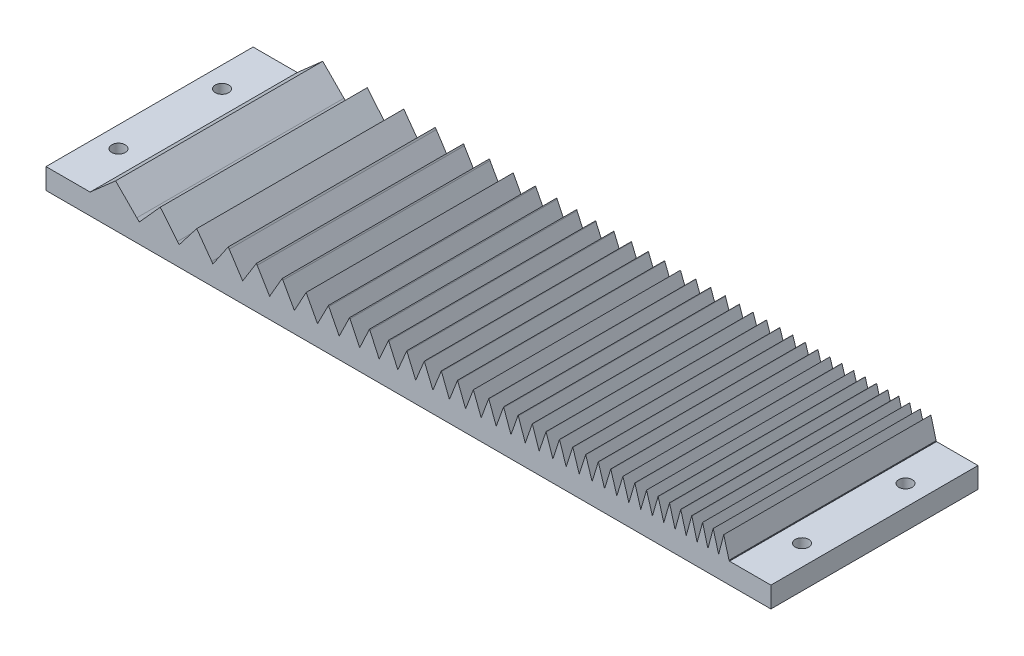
from build123d import *

# Parameters (mm, degrees)
BOSS_EXTRUDE1_DEPTH = 100
SKETCH2_R           = 3.25
CUT_EXTRUDE1_DEPTH  = 346.448103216


with BuildPart() as part:
    # Model → Boss-Extrude1 (new body)
    with BuildSketch(Plane.XY):
        with BuildLine():
            Line((0, 0), (-20, 0))
            Line((-20, 0), (-20, -10))
            Line((-20, -10), (330, -10))
            Line((330, -10), (330, 0))
            Line((330, 0), (310, 0))
            Line((310, 0), (310, 0.253453))
            Line((310, 0.253453), (309.763814, 0.253453))
            Line((309.763814, 0.253453), (307.258463, 9.740341))
            Line((307.258463, 9.740341), (304.753149, 0.239143))
            Line((304.753149, 0.239143), (302.147556, 9.732012))
            Line((302.147556, 9.732012), (299.642205, 0.23772))
            Line((299.642205, 0.23772), (299.604363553, 0.040152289))
            Line((299.604363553, 0.040152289), (299.542001, 0.275951))
            Line((299.542001, 0.275951), (297.03665, 9.74892))
            Line((297.03665, 9.74892), (294.431094, 0.238396))
            Line((294.431094, 0.238396), (294.377587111, 0.122180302))
            ThreePointArc((294.377587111, 0.122180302), (294.353256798, 0.202125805), (294.330891, 0.282643))
            Line((294.330891, 0.282643), (291.825539, 9.749881))
            Line((291.825539, 9.749881), (291.781296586, 9.925720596))
            Line((291.781296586, 9.925720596), (291.725298, 9.722045))
            Line((291.725298, 9.722045), (289.119781, 0.245373))
            Line((289.119781, 0.245373), (286.514188, 9.749419))
            Line((286.514188, 9.749419), (286.470945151, 9.925720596))
            Line((286.470945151, 9.925720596), (286.413985, 9.726423))
            Line((286.413985, 9.726423), (283.808429, 0.237648))
            Line((283.808429, 0.237648), (283.753690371, 0.105458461))
            Line((283.753690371, 0.105458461), (283.708226, 0.270859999))
            Line((283.708226, 0.270859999), (281.102633, 9.750130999))
            Line((281.102633, 9.750130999), (281.061109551, 9.925720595))
            Line((281.061109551, 9.925720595), (281.00243, 9.720406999))
            Line((281.00243, 9.720406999), (278.296671, 0.253239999))
            Line((278.296671, 0.253239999), (275.590875, 9.748634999))
            Line((275.590875, 9.748634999), (275.550945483, 9.901176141))
            Line((275.550945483, 9.901176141), (275.490671, 9.704174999))
            Line((275.490671, 9.704174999), (272.784913, 0.245657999))
            Line((272.784913, 0.245657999), (269.978913, 9.740340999))
            Line((269.978913, 9.740340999), (267.172913, 0.242275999))
            Line((267.172913, 0.242275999), (264.366914, 9.750130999))
            Line((264.366914, 9.750130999), (264.319523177, 9.901176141))
            Line((264.319523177, 9.901176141), (264.266748, 9.722827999))
            Line((264.266748, 9.722827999), (261.460748, 0.240246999))
            Line((261.460748, 0.240246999), (261.418758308, 0.089232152))
            Line((261.418758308, 0.089232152), (261.360507, 0.285632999))
            Line((261.360507, 0.285632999), (258.554545, 9.746249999))
            Line((258.554545, 9.746249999), (255.648341, 0.238573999))
            Line((255.648341, 0.238573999), (255.603358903, 0.089232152))
            Line((255.603358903, 0.089232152), (255.5481, 0.275772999))
            Line((255.5481, 0.275772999), (252.742138, 9.748029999))
            Line((252.742138, 9.748029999), (252.692373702, 9.901176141))
            Line((252.692373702, 9.901176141), (252.641934, 9.736318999))
            Line((252.641934, 9.736318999), (249.735731, 0.237683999))
            Line((249.735731, 0.237683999), (249.678575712, 0.122180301))
            Line((249.678575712, 0.122180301), (249.635528, 0.262708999))
            Line((249.635528, 0.262708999), (246.729287, 9.750094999))
            Line((246.729287, 9.750094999), (246.689957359, 9.925720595))
            Line((246.689957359, 9.925720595), (246.629083, 9.727027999))
            Line((246.629083, 9.727027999), (243.72288, 0.241243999))
            Line((243.72288, 0.241243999), (243.662304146, 0.122180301))
            Line((243.662304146, 0.122180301), (243.622676, 0.247437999))
            Line((243.622676, 0.247437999), (240.61627, 9.750165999))
            Line((240.61627, 9.750165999), (240.571616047, 9.901176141))
            Line((240.571616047, 9.901176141), (240.516029, 9.725746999))
            Line((240.516029, 9.725746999), (237.509622, 0.237719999))
            Line((237.509622, 0.237719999), (237.454474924, 0.131183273))
            Line((237.454474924, 0.131183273), (237.409418, 0.264381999))
            Line((237.409418, 0.264381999), (234.403011, 9.749026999))
            Line((234.403011, 9.749026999), (234.356979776, 9.901176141))
            Line((234.356979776, 9.901176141), (234.302808, 9.735570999))
            Line((234.302808, 9.735570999), (231.19616, 0.238431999))
            Line((231.19616, 0.238431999), (231.14296338, 0.131183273))
            Line((231.14296338, 0.131183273), (231.095956, 0.270147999))
            Line((231.095956, 0.270147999), (227.989308, 9.748884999))
            Line((227.989308, 9.748884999), (227.940952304, 9.873561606))
            Line((227.940952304, 9.873561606), (227.889105, 9.715387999))
            Line((227.889105, 9.715387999), (224.782457, 0.237755))
            Line((224.782457, 0.237755), (224.739044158, 0.089232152))
            Line((224.739044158, 0.089232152), (224.682253, 0.25712))
            Line((224.682253, 0.25712), (221.475402, 9.748635))
            Line((221.475402, 9.748635), (221.428710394, 9.873561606))
            Line((221.428710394, 9.873561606), (221.375198, 9.715423))
            Line((221.375198, 9.715423), (218.168347, 0.23861))
            Line((218.168347, 0.23861), (218.125481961, 0.099323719))
            Line((218.125481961, 0.099323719), (218.068143, 0.268831))
            Line((218.068143, 0.268831), (214.861292, 9.749027))
            Line((214.861292, 9.749027), (214.821401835, 9.901176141))
            Line((214.821401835, 9.901176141), (214.761088, 9.738028))
            Line((214.761088, 9.738028), (211.454033, 0.237826))
            Line((211.454033, 0.237826), (211.385428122, 0.163529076))
            Line((211.385428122, 0.163529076), (211.353792, 0.254343))
            Line((211.353792, 0.254343), (208.046775, 9.74739))
            Line((208.046775, 9.74739), (207.957818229, 9.999733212))
            Line((207.957818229, 9.999733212), (207.84633, 9.698159))
            Line((207.84633, 9.698159), (204.539275, 0.237826))
            Line((204.539275, 0.237826), (204.499688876, 0.089232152))
            Line((204.499688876, 0.089232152), (204.439072, 0.253275))
            Line((204.439072, 0.253275), (201.031776, 9.748671))
            Line((201.031776, 9.748671), (200.94397746, 9.999733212))
            Line((200.94397746, 9.999733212), (200.831331, 9.695025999))
            Line((200.831331, 9.695025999), (197.424072, 0.23772))
            Line((197.424072, 0.23772), (197.375215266, 0.1190555))
            Line((197.375215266, 0.1190555), (197.323869, 0.25801))
            Line((197.323869, 0.25801), (193.816407, 9.749988))
            Line((193.816407, 9.749988), (193.777319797, 9.901176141))
            Line((193.777319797, 9.901176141), (193.716203, 9.735855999))
            Line((193.716203, 9.735855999), (190.208703, 0.248113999))
            Line((190.208703, 0.248113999), (190.10836549, -1e-09))
            Line((190.10836549, -1e-09), (190.008259, 0.263242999))
            Line((190.008259, 0.263242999), (186.400556, 9.750166))
            Line((186.400556, 9.750166), (186.355107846, 9.869677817))
            Line((186.355107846, 9.869677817), (186.300352, 9.733470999))
            Line((186.300352, 9.733470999), (182.692649, 0.247722))
            Line((182.692649, 0.247722), (182.594391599, 0))
            Line((182.594391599, 0), (182.492242, 0.261392))
            Line((182.492242, 0.261392), (178.784297, 9.749703))
            Line((178.784297, 9.749703), (178.70528198, 9.999733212))
            Line((178.70528198, 9.999733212), (178.58389, 9.697767))
            Line((178.58389, 9.697767), (174.875984, 0.238111))
            Line((174.875984, 0.238111), (174.788554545, 0))
            Line((174.788554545, 0), (174.675539, 0.288089))
            Line((174.675539, 0.288089), (170.967632, 9.73995))
            Line((170.967632, 9.73995), (170.875543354, 9.999733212))
            Line((170.875543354, 9.999733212), (170.767188, 9.730196))
            Line((170.767188, 9.730196), (166.959077, 0.257405))
            Line((166.959077, 0.257405), (166.811324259, -0.085810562))
            Line((166.811324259, -0.085810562), (166.658429, 0.284458))
            Line((166.658429, 0.284458), (162.750115, 9.749276))
            Line((162.750115, 9.749276), (162.670030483, 9.999733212))
            Line((162.670030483, 9.999733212), (162.549671, 9.708553))
            Line((162.549671, 9.708553), (158.641357, 0.253347))
            Line((158.641357, 0.253347), (158.498065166, -0.085810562))
            Line((158.498065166, -0.085810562), (158.340709, 0.285455))
            Line((158.340709, 0.285455), (154.332154, 9.743225))
            Line((154.332154, 9.743225), (154.214838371, 10.117055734))
            Line((154.214838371, 10.117055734), (154.031505, 9.685807))
            Line((154.031505, 9.685807), (150.02295, 0.256622))
            Line((150.02295, 0.256622), (149.882581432, -0.085810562))
            Line((149.882581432, -0.085810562), (149.722302, 0.274812))
            Line((149.722302, 0.274812), (145.513303, 9.744898))
            Line((145.513303, 9.744898), (145.385772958, 10.075413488))
            Line((145.385772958, 10.075413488), (145.212655, 9.687266))
            Line((145.212655, 9.687266), (141.003692, 0.250357))
            Line((141.003692, 0.250357), (140.869504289, -0.085810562))
            Line((140.869504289, -0.085810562), (140.703044, 0.279119))
            Line((140.703044, 0.279119), (136.393879, 9.726067))
            Line((136.393879, 9.726067), (136.239488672, 10.166299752))
            Line((136.239488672, 10.166299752), (135.992989, 9.684205))
            Line((135.992989, 9.684205), (131.583583, 0.249004))
            Line((131.583583, 0.249004), (131.439381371, -0.05181507))
            Line((131.439381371, -0.05181507), (131.282935, 0.275773))
            Line((131.282935, 0.275773), (126.773324, 9.718592))
            Line((126.773324, 9.718592), (126.60876182, 10.166299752))
            Line((126.60876182, 10.166299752), (126.372473, 9.704175))
            Line((126.372473, 9.704175), (121.762621, 0.269223))
            Line((121.762621, 0.269223), (121.537813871, -0.05181507))
            Line((121.537813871, -0.05181507), (121.36177, 0.279297))
            Line((121.36177, 0.279297), (116.551511, 9.735251))
            Line((116.551511, 9.735251), (116.395065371, 10.166299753))
            Line((116.395065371, 10.166299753), (116.150659, 9.688299))
            Line((116.150659, 9.688299), (111.340401, 0.280578))
            Line((111.340401, 0.280578), (111.09993836, -0.193680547))
            Line((111.09993836, -0.193680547), (110.839308, 0.296526))
            Line((110.839308, 0.296526), (105.828643, 9.720834))
            Line((105.828643, 9.720834), (105.591800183, 10.166299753))
            Line((105.591800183, 10.166299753), (105.32755, 9.680325))
            Line((105.32755, 9.680325), (100.216643, 0.281006))
            Line((100.216643, 0.281006), (99.945117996, -0.266941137))
            Line((99.945117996, -0.266941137), (99.615384, 0.325573))
            Line((99.615384, 0.325573), (94.404237, 9.689722))
            Line((94.404237, 9.689722), (94.116250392, 10.309744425))
            Line((94.116250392, 10.309744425), (93.702774, 9.646614))
            Line((93.702774, 9.646614), (88.291219, 0.287733))
            Line((88.291219, 0.287733), (87.997290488, -0.338003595))
            Line((87.997290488, -0.338003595), (87.589719, 0.340951))
            Line((87.589719, 0.340951), (81.97772, 9.689722))
            Line((81.97772, 9.689722), (81.638904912, 10.369270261))
            Line((81.638904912, 10.369270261), (81.176017, 9.626894))
            Line((81.176017, 9.626894), (75.36361, 0.304998))
            Line((75.36361, 0.304998), (74.988262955, -0.317263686))
            Line((74.988262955, -0.317263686), (74.561907, 0.333369))
            Line((74.561907, 0.333369), (68.448889, 9.662028))
            Line((68.448889, 9.662028), (68.003877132, 10.4246389))
            Line((68.003877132, 10.4246389), (67.446741, 9.607137))
            Line((67.446741, 9.607137), (61.133242, 0.343158))
            Line((61.133242, 0.343158), (60.573698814, -0.47787584))
            Line((60.573698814, -0.47787584), (60.03089, 0.37815))
            Line((60.03089, 0.37815), (53.316577, 9.640848))
            Line((53.316577, 9.640848), (52.74842532, 10.4246389))
            Line((52.74842532, 10.4246389), (52.114021, 9.602083))
            Line((52.114021, 9.602083), (44.998819, 0.376655))
            Line((44.998819, 0.376655), (44.309882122, -0.516606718))
            Line((44.309882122, -0.516606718), (43.495615, 0.443328))
            Line((43.495615, 0.443328), (35.979561, 9.576453))
            Line((35.979561, 9.576453), (35.144685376, 10.590951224))
            Line((35.144685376, 10.590951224), (34.175746, 9.510136))
            Line((34.175746, 9.510136), (26.058395, 0.455538))
            Line((26.058395, 0.455538), (25.062838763, -0.654967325))
            Line((25.062838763, -0.654967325), (23.853692, 0.512386))
            Line((23.853692, 0.512386), (15.034879, 9.410428))
            Line((15.034879, 9.410428), (13.615981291, 10.842073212))
            Line((13.615981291, 10.842073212), (11.928268, 9.355538))
            Line((11.928268, 9.355538), (2.107307, 0.705251))
            Line((2.107307, 0.705251), (1.306611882, 0))
            Line((1.306611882, 0), (0, 0))
        make_face()
    extrude(amount=BOSS_EXTRUDE1_DEPTH)

    # Sketch2 → Cut-Extrude1 (cut, through all)
    with BuildSketch(Plane.XZ.offset(10)):
        with Locations(Location((-10, 75, 0), (0, 0, 270))):
            Circle(SKETCH2_R)
        with Locations(Location((-10, 25, 0), (0, 0, 270))):
            Circle(SKETCH2_R)
        with Locations(Location((320, 25, 0), (0, 0, 270))):
            Circle(SKETCH2_R)
        with Locations(Location((320, 75, 0), (0, 0, 270))):
            Circle(SKETCH2_R)
    extrude(amount=-CUT_EXTRUDE1_DEPTH, mode=Mode.SUBTRACT)


solid = part.part
